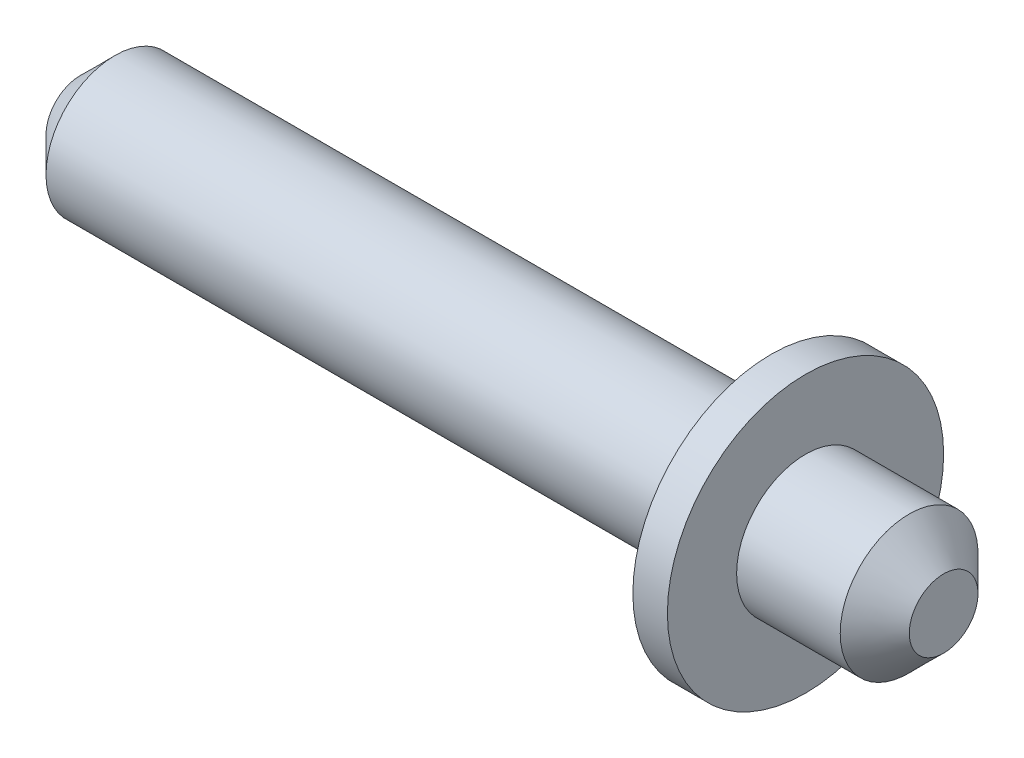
ISO-10303-21;
HEADER;
FILE_DESCRIPTION(('STEP AP214'),'2;1');
FILE_NAME('part.step','',(''),(''),'','','');
FILE_SCHEMA(('AUTOMOTIVE_DESIGN { 1 0 10303 214 1 1 1 1 }'));
ENDSEC;
DATA;
#1=APPLICATION_CONTEXT('core data for automotive mechanical design processes');
#2=APPLICATION_PROTOCOL_DEFINITION('international standard','automotive_design',2000,#1);
#3=PRODUCT_CONTEXT('',#1,'mechanical');
#4=PRODUCT('Part','Part','',(#3));
#5=PRODUCT_RELATED_PRODUCT_CATEGORY('part','',(#4));
#6=PRODUCT_DEFINITION_FORMATION('','',#4);
#7=PRODUCT_DEFINITION_CONTEXT('part definition',#1,'design');
#8=PRODUCT_DEFINITION('design','',#6,#7);
#9=PRODUCT_DEFINITION_SHAPE('','',#8);
#10=(LENGTH_UNIT() NAMED_UNIT(*) SI_UNIT(.MILLI.,.METRE.));
#11=(NAMED_UNIT(*) PLANE_ANGLE_UNIT() SI_UNIT($,.RADIAN.));
#12=(NAMED_UNIT(*) SI_UNIT($,.STERADIAN.) SOLID_ANGLE_UNIT());
#13=UNCERTAINTY_MEASURE_WITH_UNIT(LENGTH_MEASURE(1.E-05),#10,'distance_accuracy_value','');
#14=(GEOMETRIC_REPRESENTATION_CONTEXT(3) GLOBAL_UNCERTAINTY_ASSIGNED_CONTEXT((#13)) GLOBAL_UNIT_ASSIGNED_CONTEXT((#10,
#11,#12)) REPRESENTATION_CONTEXT('',''));
#15=CARTESIAN_POINT('',(0.,0.,0.));
#16=DIRECTION('',(0.,0.,1.));
#17=DIRECTION('',(1.,0.,0.));
#18=AXIS2_PLACEMENT_3D('',#15,#16,#17);
#19=CARTESIAN_POINT('',(0.,0.,0.));
#20=DIRECTION('',(1.,0.,0.));
#21=DIRECTION('',(0.,0.,-1.));
#22=AXIS2_PLACEMENT_3D('',#19,#20,#21);
#23=PLANE('',#22);
#24=CARTESIAN_POINT('',(0.,0.,0.));
#25=DIRECTION('',(1.,0.,0.));
#26=DIRECTION('',(0.,0.,-1.));
#27=AXIS2_PLACEMENT_3D('',#24,#25,#26);
#28=CIRCLE('',#27,0.995000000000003);
#29=CARTESIAN_POINT('',(0.,0.,-0.995000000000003));
#30=VERTEX_POINT('',#29);
#31=EDGE_CURVE('E35',#30,#30,#28,.F.);
#32=ORIENTED_EDGE('',*,*,#31,.T.);
#33=EDGE_LOOP('',(#32));
#34=FACE_BOUND('',#33,.T.);
#35=ADVANCED_FACE('F28',(#34),#23,.F.);
#36=CARTESIAN_POINT('',(0.,0.,0.));
#37=DIRECTION('',(-1.,0.,0.));
#38=DIRECTION('',(0.,0.,1.));
#39=AXIS2_PLACEMENT_3D('',#36,#37,#38);
#40=CYLINDRICAL_SURFACE('',#39,1.995);
#41=CARTESIAN_POINT('',(1.,0.,0.));
#42=DIRECTION('',(1.,0.,0.));
#43=DIRECTION('',(0.,0.,-1.));
#44=AXIS2_PLACEMENT_3D('',#41,#42,#43);
#45=CIRCLE('',#44,1.995);
#46=CARTESIAN_POINT('',(1.,0.,-1.995));
#47=VERTEX_POINT('',#46);
#48=EDGE_CURVE('E10',#47,#47,#45,.T.);
#49=ORIENTED_EDGE('',*,*,#48,.T.);
#50=EDGE_LOOP('',(#49));
#51=FACE_BOUND('',#50,.T.);
#52=CARTESIAN_POINT('',(20.,0.,0.));
#53=DIRECTION('',(-1.,0.,0.));
#54=DIRECTION('',(0.,0.,1.));
#55=AXIS2_PLACEMENT_3D('',#52,#53,#54);
#56=CIRCLE('',#55,1.995);
#57=CARTESIAN_POINT('',(20.,0.,1.995));
#58=VERTEX_POINT('',#57);
#59=EDGE_CURVE('E48',#58,#58,#56,.T.);
#60=ORIENTED_EDGE('',*,*,#59,.T.);
#61=EDGE_LOOP('',(#60));
#62=FACE_BOUND('',#61,.T.);
#63=ADVANCED_FACE('F79',(#51,#62),#40,.T.);
#64=CARTESIAN_POINT('',(20.,1.995,0.));
#65=DIRECTION('',(1.,0.,0.));
#66=DIRECTION('',(0.,0.,-1.));
#67=AXIS2_PLACEMENT_3D('',#64,#65,#66);
#68=PLANE('',#67);
#69=ORIENTED_EDGE('',*,*,#59,.F.);
#70=EDGE_LOOP('',(#69));
#71=FACE_BOUND('',#70,.T.);
#72=CARTESIAN_POINT('',(20.,0.,0.));
#73=DIRECTION('',(-1.,0.,0.));
#74=DIRECTION('',(0.,0.,1.));
#75=AXIS2_PLACEMENT_3D('',#72,#73,#74);
#76=CIRCLE('',#75,4.);
#77=CARTESIAN_POINT('',(20.,0.,4.));
#78=VERTEX_POINT('',#77);
#79=EDGE_CURVE('E51',#78,#78,#76,.T.);
#80=ORIENTED_EDGE('',*,*,#79,.T.);
#81=EDGE_LOOP('',(#80));
#82=FACE_BOUND('',#81,.T.);
#83=ADVANCED_FACE('F84',(#71,#82),#68,.F.);
#84=CARTESIAN_POINT('',(0.,0.,0.));
#85=DIRECTION('',(-1.,0.,0.));
#86=DIRECTION('',(0.,0.,1.));
#87=AXIS2_PLACEMENT_3D('',#84,#85,#86);
#88=CYLINDRICAL_SURFACE('',#87,4.);
#89=ORIENTED_EDGE('',*,*,#79,.F.);
#90=EDGE_LOOP('',(#89));
#91=FACE_BOUND('',#90,.T.);
#92=CARTESIAN_POINT('',(21.,0.,0.));
#93=DIRECTION('',(-1.,0.,0.));
#94=DIRECTION('',(0.,0.,1.));
#95=AXIS2_PLACEMENT_3D('',#92,#93,#94);
#96=CIRCLE('',#95,4.);
#97=CARTESIAN_POINT('',(21.,0.,4.));
#98=VERTEX_POINT('',#97);
#99=EDGE_CURVE('E54',#98,#98,#96,.T.);
#100=ORIENTED_EDGE('',*,*,#99,.T.);
#101=EDGE_LOOP('',(#100));
#102=FACE_BOUND('',#101,.T.);
#103=ADVANCED_FACE('F75',(#91,#102),#88,.T.);
#104=CARTESIAN_POINT('',(21.,4.,0.));
#105=DIRECTION('',(-1.,0.,0.));
#106=DIRECTION('',(0.,0.,1.));
#107=AXIS2_PLACEMENT_3D('',#104,#105,#106);
#108=PLANE('',#107);
#109=ORIENTED_EDGE('',*,*,#99,.F.);
#110=EDGE_LOOP('',(#109));
#111=FACE_BOUND('',#110,.T.);
#112=CARTESIAN_POINT('',(21.,0.,0.));
#113=DIRECTION('',(-1.,0.,0.));
#114=DIRECTION('',(0.,0.,1.));
#115=AXIS2_PLACEMENT_3D('',#112,#113,#114);
#116=CIRCLE('',#115,1.995);
#117=CARTESIAN_POINT('',(21.,0.,1.995));
#118=VERTEX_POINT('',#117);
#119=EDGE_CURVE('E57',#118,#118,#116,.T.);
#120=ORIENTED_EDGE('',*,*,#119,.T.);
#121=EDGE_LOOP('',(#120));
#122=FACE_BOUND('',#121,.T.);
#123=ADVANCED_FACE('F61',(#111,#122),#108,.F.);
#124=CARTESIAN_POINT('',(0.,0.,0.));
#125=DIRECTION('',(-1.,0.,0.));
#126=DIRECTION('',(0.,0.,1.));
#127=AXIS2_PLACEMENT_3D('',#124,#125,#126);
#128=CYLINDRICAL_SURFACE('',#127,1.995);
#129=CARTESIAN_POINT('',(24.,0.,0.));
#130=DIRECTION('',(-1.,0.,0.));
#131=DIRECTION('',(0.,0.,1.));
#132=AXIS2_PLACEMENT_3D('',#129,#130,#131);
#133=CIRCLE('',#132,1.995);
#134=CARTESIAN_POINT('',(24.,0.,1.995));
#135=VERTEX_POINT('',#134);
#136=EDGE_CURVE('E43',#135,#135,#133,.T.);
#137=ORIENTED_EDGE('',*,*,#136,.T.);
#138=EDGE_LOOP('',(#137));
#139=FACE_BOUND('',#138,.T.);
#140=ORIENTED_EDGE('',*,*,#119,.F.);
#141=EDGE_LOOP('',(#140));
#142=FACE_BOUND('',#141,.T.);
#143=ADVANCED_FACE('F63',(#139,#142),#128,.T.);
#144=CARTESIAN_POINT('',(25.,1.995,0.));
#145=DIRECTION('',(-1.,0.,0.));
#146=DIRECTION('',(0.,0.,1.));
#147=AXIS2_PLACEMENT_3D('',#144,#145,#146);
#148=PLANE('',#147);
#149=CARTESIAN_POINT('',(25.,0.,0.));
#150=DIRECTION('',(-1.,0.,0.));
#151=DIRECTION('',(0.,0.,1.));
#152=AXIS2_PLACEMENT_3D('',#149,#150,#151);
#153=CIRCLE('',#152,0.994999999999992);
#154=CARTESIAN_POINT('',(25.,0.,0.994999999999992));
#155=VERTEX_POINT('',#154);
#156=EDGE_CURVE('E39',#155,#155,#153,.F.);
#157=ORIENTED_EDGE('',*,*,#156,.T.);
#158=EDGE_LOOP('',(#157));
#159=FACE_BOUND('',#158,.T.);
#160=ADVANCED_FACE('F65',(#159),#148,.F.);
#161=CARTESIAN_POINT('',(24.,0.,0.));
#162=DIRECTION('',(-1.,0.,0.));
#163=DIRECTION('',(0.,0.,1.));
#164=AXIS2_PLACEMENT_3D('',#161,#162,#163);
#165=CONICAL_SURFACE('',#164,1.995,0.785398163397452);
#166=ORIENTED_EDGE('',*,*,#156,.F.);
#167=EDGE_LOOP('',(#166));
#168=FACE_BOUND('',#167,.T.);
#169=ORIENTED_EDGE('',*,*,#136,.F.);
#170=EDGE_LOOP('',(#169));
#171=FACE_BOUND('',#170,.T.);
#172=ADVANCED_FACE('F72',(#168,#171),#165,.T.);
#173=CARTESIAN_POINT('',(0.,0.,0.));
#174=DIRECTION('',(1.,0.,0.));
#175=DIRECTION('',(0.,0.,-1.));
#176=AXIS2_PLACEMENT_3D('',#173,#174,#175);
#177=CONICAL_SURFACE('',#176,0.995000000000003,0.785398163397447);
#178=ORIENTED_EDGE('',*,*,#48,.F.);
#179=EDGE_LOOP('',(#178));
#180=FACE_BOUND('',#179,.T.);
#181=ORIENTED_EDGE('',*,*,#31,.F.);
#182=EDGE_LOOP('',(#181));
#183=FACE_BOUND('',#182,.T.);
#184=ADVANCED_FACE('F30',(#180,#183),#177,.T.);
#185=CLOSED_SHELL('',(#35,#63,#83,#103,#123,#143,#160,#172,#184));
#186=MANIFOLD_SOLID_BREP('B2',#185);
#187=ADVANCED_BREP_SHAPE_REPRESENTATION('',(#18,#186),#14);
#188=SHAPE_DEFINITION_REPRESENTATION(#9,#187);
ENDSEC;
END-ISO-10303-21;
